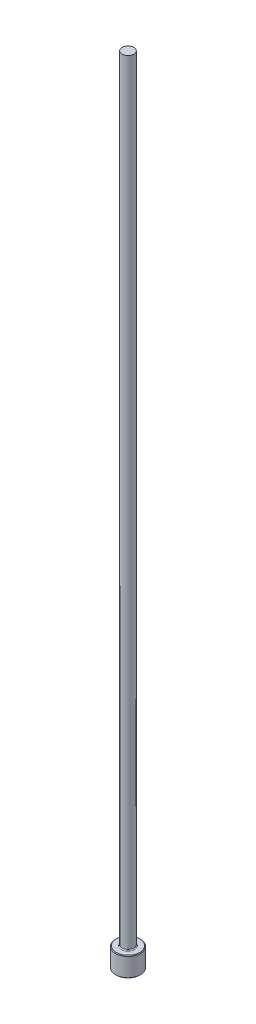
from build123d import *

# Parameters (mm, degrees)
CHAMFER1_SIZE = 0.0508
FILLET1_R     = 0.0762


with BuildPart() as part:
    # Sketch1 → Revolve1 (revolve)
    with BuildSketch(Plane.XY, mode=Mode.PRIVATE) as revolve1_sk:
        Polygon((0, 0), (-0.9906, 0), (-0.9906, 1.5748), (-0.4699, 1.5748), (-0.4699, 63.5), (0, 63.5), align=None)
    revolve(revolve1_sk.sketch.rotate(Axis((0, 259.958771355, 0), (0, -1, 0)), 270), axis=Axis((0, 259.958771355, 0), (0, -1, 0)))

    # Chamfer1
    chamfer1_edges = [part.edges().sort_by_distance(p)[0] for p in [
        (0, 1.5748, -0.9906),
        (0, 0, -0.9906),
    ]]
    chamfer(chamfer1_edges, length=CHAMFER1_SIZE)

    # Fillet1
    fillet1_edges = [part.edges().sort_by_distance(p)[0] for p in [
        (0, 1.5748, -0.4699),
    ]]
    fillet(fillet1_edges, radius=FILLET1_R)


solid = part.part
